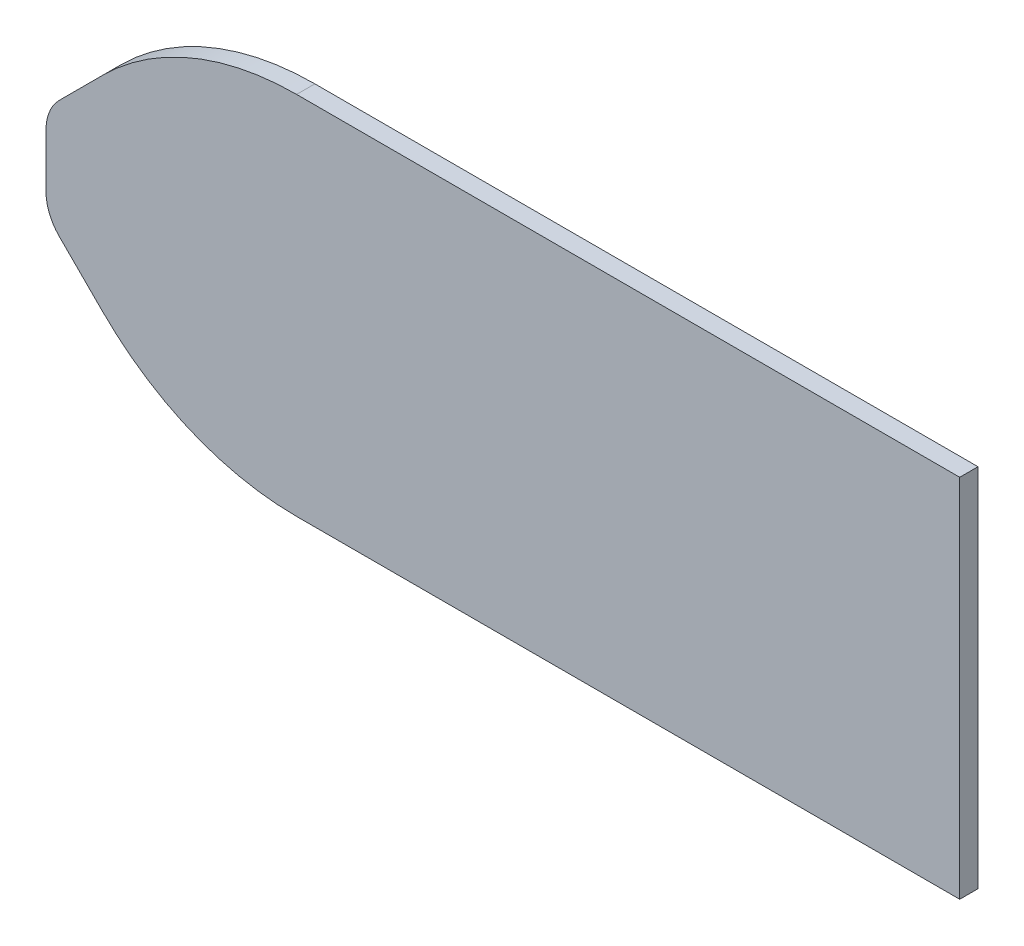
ISO-10303-21;
HEADER;
FILE_DESCRIPTION(('STEP AP214'),'2;1');
FILE_NAME('part.step','',(''),(''),'','','');
FILE_SCHEMA(('AUTOMOTIVE_DESIGN { 1 0 10303 214 1 1 1 1 }'));
ENDSEC;
DATA;
#1=APPLICATION_CONTEXT('core data for automotive mechanical design processes');
#2=APPLICATION_PROTOCOL_DEFINITION('international standard','automotive_design',2000,#1);
#3=PRODUCT_CONTEXT('',#1,'mechanical');
#4=PRODUCT('Part','Part','',(#3));
#5=PRODUCT_RELATED_PRODUCT_CATEGORY('part','',(#4));
#6=PRODUCT_DEFINITION_FORMATION('','',#4);
#7=PRODUCT_DEFINITION_CONTEXT('part definition',#1,'design');
#8=PRODUCT_DEFINITION('design','',#6,#7);
#9=PRODUCT_DEFINITION_SHAPE('','',#8);
#10=(LENGTH_UNIT() NAMED_UNIT(*) SI_UNIT(.MILLI.,.METRE.));
#11=(NAMED_UNIT(*) PLANE_ANGLE_UNIT() SI_UNIT($,.RADIAN.));
#12=(NAMED_UNIT(*) SI_UNIT($,.STERADIAN.) SOLID_ANGLE_UNIT());
#13=UNCERTAINTY_MEASURE_WITH_UNIT(LENGTH_MEASURE(1.E-05),#10,'distance_accuracy_value','');
#14=(GEOMETRIC_REPRESENTATION_CONTEXT(3) GLOBAL_UNCERTAINTY_ASSIGNED_CONTEXT((#13)) GLOBAL_UNIT_ASSIGNED_CONTEXT((#10,
#11,#12)) REPRESENTATION_CONTEXT('',''));
#15=CARTESIAN_POINT('',(0.,0.,0.));
#16=DIRECTION('',(0.,0.,1.));
#17=DIRECTION('',(1.,0.,0.));
#18=AXIS2_PLACEMENT_3D('',#15,#16,#17);
#19=CARTESIAN_POINT('',(100.,40.,4.));
#20=DIRECTION('',(-1.,0.,0.));
#21=DIRECTION('',(0.,0.,1.));
#22=AXIS2_PLACEMENT_3D('',#19,#20,#21);
#23=PLANE('',#22);
#24=DIRECTION('',(0.,1.,0.));
#25=VECTOR('',#24,1.);
#26=CARTESIAN_POINT('',(100.,40.,0.));
#27=LINE('',#26,#25);
#28=CARTESIAN_POINT('',(100.,-40.,0.));
#29=VERTEX_POINT('',#28);
#30=CARTESIAN_POINT('',(100.,40.,0.));
#31=VERTEX_POINT('',#30);
#32=EDGE_CURVE('E152',#29,#31,#27,.T.);
#33=ORIENTED_EDGE('',*,*,#32,.T.);
#34=DIRECTION('',(0.,0.,-1.));
#35=VECTOR('',#34,1.);
#36=CARTESIAN_POINT('',(100.,40.,4.));
#37=LINE('',#36,#35);
#38=CARTESIAN_POINT('',(100.,40.,4.));
#39=VERTEX_POINT('',#38);
#40=EDGE_CURVE('E11',#39,#31,#37,.T.);
#41=ORIENTED_EDGE('',*,*,#40,.F.);
#42=DIRECTION('',(0.,1.,0.));
#43=VECTOR('',#42,1.);
#44=CARTESIAN_POINT('',(100.,40.,4.));
#45=LINE('',#44,#43);
#46=CARTESIAN_POINT('',(100.,-40.,4.));
#47=VERTEX_POINT('',#46);
#48=EDGE_CURVE('E180',#47,#39,#45,.T.);
#49=ORIENTED_EDGE('',*,*,#48,.F.);
#50=DIRECTION('',(0.,0.,-1.));
#51=VECTOR('',#50,1.);
#52=CARTESIAN_POINT('',(100.,-40.,4.));
#53=LINE('',#52,#51);
#54=EDGE_CURVE('E148',#47,#29,#53,.T.);
#55=ORIENTED_EDGE('',*,*,#54,.T.);
#56=EDGE_LOOP('',(#33,#41,#49,#55));
#57=FACE_BOUND('',#56,.T.);
#58=ADVANCED_FACE('F39',(#57),#23,.F.);
#59=CARTESIAN_POINT('',(-45.147186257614,40.,4.));
#60=DIRECTION('',(0.,-1.,0.));
#61=DIRECTION('',(0.,0.,-1.));
#62=AXIS2_PLACEMENT_3D('',#59,#60,#61);
#63=PLANE('',#62);
#64=DIRECTION('',(-1.,0.,0.));
#65=VECTOR('',#64,1.);
#66=CARTESIAN_POINT('',(-45.147186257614,40.,0.));
#67=LINE('',#66,#65);
#68=CARTESIAN_POINT('',(-45.147186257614,40.,0.));
#69=VERTEX_POINT('',#68);
#70=EDGE_CURVE('E156',#31,#69,#67,.T.);
#71=ORIENTED_EDGE('',*,*,#70,.T.);
#72=DIRECTION('',(0.,0.,-1.));
#73=VECTOR('',#72,1.);
#74=CARTESIAN_POINT('',(-45.147186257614,40.,4.));
#75=LINE('',#74,#73);
#76=CARTESIAN_POINT('',(-45.147186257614,40.,4.));
#77=VERTEX_POINT('',#76);
#78=EDGE_CURVE('E48',#77,#69,#75,.T.);
#79=ORIENTED_EDGE('',*,*,#78,.F.);
#80=DIRECTION('',(-1.,0.,0.));
#81=VECTOR('',#80,1.);
#82=CARTESIAN_POINT('',(-45.147186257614,40.,4.));
#83=LINE('',#82,#81);
#84=EDGE_CURVE('E105',#39,#77,#83,.T.);
#85=ORIENTED_EDGE('',*,*,#84,.F.);
#86=ORIENTED_EDGE('',*,*,#40,.T.);
#87=EDGE_LOOP('',(#71,#79,#85,#86));
#88=FACE_BOUND('',#87,.T.);
#89=ADVANCED_FACE('F244',(#88),#63,.F.);
#90=CARTESIAN_POINT('',(-45.1471862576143,-20.,4.));
#91=DIRECTION('',(0.,0.,-1.));
#92=DIRECTION('',(-1.,0.,0.));
#93=AXIS2_PLACEMENT_3D('',#90,#91,#92);
#94=CYLINDRICAL_SURFACE('',#93,60.);
#95=CARTESIAN_POINT('',(-45.1471862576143,-20.,0.));
#96=DIRECTION('',(0.,0.,1.));
#97=DIRECTION('',(-1.,0.,0.));
#98=AXIS2_PLACEMENT_3D('',#95,#96,#97);
#99=CIRCLE('',#98,60.);
#100=CARTESIAN_POINT('',(-87.5735931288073,22.4264068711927,0.));
#101=VERTEX_POINT('',#100);
#102=EDGE_CURVE('E159',#69,#101,#99,.T.);
#103=ORIENTED_EDGE('',*,*,#102,.T.);
#104=DIRECTION('',(0.,0.,-1.));
#105=VECTOR('',#104,1.);
#106=CARTESIAN_POINT('',(-87.5735931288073,22.4264068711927,4.));
#107=LINE('',#106,#105);
#108=CARTESIAN_POINT('',(-87.5735931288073,22.4264068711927,4.));
#109=VERTEX_POINT('',#108);
#110=EDGE_CURVE('E199',#109,#101,#107,.T.);
#111=ORIENTED_EDGE('',*,*,#110,.F.);
#112=CARTESIAN_POINT('',(-45.1471862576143,-20.,4.));
#113=DIRECTION('',(0.,0.,1.));
#114=DIRECTION('',(-1.,0.,0.));
#115=AXIS2_PLACEMENT_3D('',#112,#113,#114);
#116=CIRCLE('',#115,60.);
#117=EDGE_CURVE('E209',#77,#109,#116,.T.);
#118=ORIENTED_EDGE('',*,*,#117,.F.);
#119=ORIENTED_EDGE('',*,*,#78,.T.);
#120=EDGE_LOOP('',(#103,#111,#118,#119));
#121=FACE_BOUND('',#120,.T.);
#122=ADVANCED_FACE('F207',(#121),#94,.T.);
#123=CARTESIAN_POINT('',(-97.0710678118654,12.9289321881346,4.));
#124=DIRECTION('',(0.707106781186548,-0.707106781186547,0.));
#125=DIRECTION('',(0.707106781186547,0.707106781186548,0.));
#126=AXIS2_PLACEMENT_3D('',#123,#124,#125);
#127=PLANE('',#126);
#128=DIRECTION('',(-0.707106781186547,-0.707106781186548,0.));
#129=VECTOR('',#128,1.);
#130=CARTESIAN_POINT('',(-97.0710678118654,12.9289321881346,0.));
#131=LINE('',#130,#129);
#132=CARTESIAN_POINT('',(-97.0710678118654,12.9289321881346,0.));
#133=VERTEX_POINT('',#132);
#134=EDGE_CURVE('E162',#101,#133,#131,.T.);
#135=ORIENTED_EDGE('',*,*,#134,.T.);
#136=DIRECTION('',(0.,0.,-1.));
#137=VECTOR('',#136,1.);
#138=CARTESIAN_POINT('',(-97.0710678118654,12.9289321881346,4.));
#139=LINE('',#138,#137);
#140=CARTESIAN_POINT('',(-97.0710678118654,12.9289321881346,4.));
#141=VERTEX_POINT('',#140);
#142=EDGE_CURVE('E195',#141,#133,#139,.T.);
#143=ORIENTED_EDGE('',*,*,#142,.F.);
#144=DIRECTION('',(-0.707106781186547,-0.707106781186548,0.));
#145=VECTOR('',#144,1.);
#146=CARTESIAN_POINT('',(-97.0710678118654,12.9289321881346,4.));
#147=LINE('',#146,#145);
#148=EDGE_CURVE('E228',#109,#141,#147,.T.);
#149=ORIENTED_EDGE('',*,*,#148,.F.);
#150=ORIENTED_EDGE('',*,*,#110,.T.);
#151=EDGE_LOOP('',(#135,#143,#149,#150));
#152=FACE_BOUND('',#151,.T.);
#153=ADVANCED_FACE('F218',(#152),#127,.F.);
#154=CARTESIAN_POINT('',(-90.,5.85786437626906,4.));
#155=DIRECTION('',(0.,0.,-1.));
#156=DIRECTION('',(-1.,0.,0.));
#157=AXIS2_PLACEMENT_3D('',#154,#155,#156);
#158=CYLINDRICAL_SURFACE('',#157,9.99999999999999);
#159=CARTESIAN_POINT('',(-90.,5.85786437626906,0.));
#160=DIRECTION('',(0.,0.,1.));
#161=DIRECTION('',(1.,0.,0.));
#162=AXIS2_PLACEMENT_3D('',#159,#160,#161);
#163=CIRCLE('',#162,9.99999999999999);
#164=CARTESIAN_POINT('',(-100.,5.85786437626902,0.));
#165=VERTEX_POINT('',#164);
#166=EDGE_CURVE('E165',#133,#165,#163,.T.);
#167=ORIENTED_EDGE('',*,*,#166,.T.);
#168=DIRECTION('',(0.,0.,-1.));
#169=VECTOR('',#168,1.);
#170=CARTESIAN_POINT('',(-100.,5.85786437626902,4.));
#171=LINE('',#170,#169);
#172=CARTESIAN_POINT('',(-100.,5.85786437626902,4.));
#173=VERTEX_POINT('',#172);
#174=EDGE_CURVE('E191',#173,#165,#171,.T.);
#175=ORIENTED_EDGE('',*,*,#174,.F.);
#176=CARTESIAN_POINT('',(-90.,5.85786437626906,4.));
#177=DIRECTION('',(0.,0.,1.));
#178=DIRECTION('',(1.,0.,0.));
#179=AXIS2_PLACEMENT_3D('',#176,#177,#178);
#180=CIRCLE('',#179,9.99999999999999);
#181=EDGE_CURVE('E224',#141,#173,#180,.T.);
#182=ORIENTED_EDGE('',*,*,#181,.F.);
#183=ORIENTED_EDGE('',*,*,#142,.T.);
#184=EDGE_LOOP('',(#167,#175,#182,#183));
#185=FACE_BOUND('',#184,.T.);
#186=ADVANCED_FACE('F222',(#185),#158,.T.);
#187=CARTESIAN_POINT('',(-100.,5.85786437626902,4.));
#188=DIRECTION('',(1.,0.,0.));
#189=DIRECTION('',(0.,0.,-1.));
#190=AXIS2_PLACEMENT_3D('',#187,#188,#189);
#191=PLANE('',#190);
#192=DIRECTION('',(0.,-1.,0.));
#193=VECTOR('',#192,1.);
#194=CARTESIAN_POINT('',(-100.,5.85786437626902,0.));
#195=LINE('',#194,#193);
#196=CARTESIAN_POINT('',(-100.,-5.85786437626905,0.));
#197=VERTEX_POINT('',#196);
#198=EDGE_CURVE('E168',#165,#197,#195,.T.);
#199=ORIENTED_EDGE('',*,*,#198,.T.);
#200=DIRECTION('',(0.,0.,-1.));
#201=VECTOR('',#200,1.);
#202=CARTESIAN_POINT('',(-100.,-5.85786437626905,4.));
#203=LINE('',#202,#201);
#204=CARTESIAN_POINT('',(-100.,-5.85786437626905,4.));
#205=VERTEX_POINT('',#204);
#206=EDGE_CURVE('E187',#205,#197,#203,.T.);
#207=ORIENTED_EDGE('',*,*,#206,.F.);
#208=DIRECTION('',(0.,-1.,0.));
#209=VECTOR('',#208,1.);
#210=CARTESIAN_POINT('',(-100.,5.85786437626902,4.));
#211=LINE('',#210,#209);
#212=EDGE_CURVE('E227',#173,#205,#211,.T.);
#213=ORIENTED_EDGE('',*,*,#212,.F.);
#214=ORIENTED_EDGE('',*,*,#174,.T.);
#215=EDGE_LOOP('',(#199,#207,#213,#214));
#216=FACE_BOUND('',#215,.T.);
#217=ADVANCED_FACE('F256',(#216),#191,.F.);
#218=CARTESIAN_POINT('',(-90.,-5.85786437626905,4.));
#219=DIRECTION('',(0.,0.,-1.));
#220=DIRECTION('',(-1.,0.,0.));
#221=AXIS2_PLACEMENT_3D('',#218,#219,#220);
#222=CYLINDRICAL_SURFACE('',#221,9.99999999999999);
#223=CARTESIAN_POINT('',(-90.,-5.85786437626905,0.));
#224=DIRECTION('',(0.,0.,1.));
#225=DIRECTION('',(-1.,0.,0.));
#226=AXIS2_PLACEMENT_3D('',#223,#224,#225);
#227=CIRCLE('',#226,9.99999999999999);
#228=CARTESIAN_POINT('',(-97.0710678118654,-12.9289321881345,0.));
#229=VERTEX_POINT('',#228);
#230=EDGE_CURVE('E171',#197,#229,#227,.T.);
#231=ORIENTED_EDGE('',*,*,#230,.T.);
#232=DIRECTION('',(0.,0.,-1.));
#233=VECTOR('',#232,1.);
#234=CARTESIAN_POINT('',(-97.0710678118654,-12.9289321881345,4.));
#235=LINE('',#234,#233);
#236=CARTESIAN_POINT('',(-97.0710678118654,-12.9289321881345,4.));
#237=VERTEX_POINT('',#236);
#238=EDGE_CURVE('E141',#237,#229,#235,.T.);
#239=ORIENTED_EDGE('',*,*,#238,.F.);
#240=CARTESIAN_POINT('',(-90.,-5.85786437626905,4.));
#241=DIRECTION('',(0.,0.,1.));
#242=DIRECTION('',(-1.,0.,0.));
#243=AXIS2_PLACEMENT_3D('',#240,#241,#242);
#244=CIRCLE('',#243,9.99999999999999);
#245=EDGE_CURVE('E130',#205,#237,#244,.T.);
#246=ORIENTED_EDGE('',*,*,#245,.F.);
#247=ORIENTED_EDGE('',*,*,#206,.T.);
#248=EDGE_LOOP('',(#231,#239,#246,#247));
#249=FACE_BOUND('',#248,.T.);
#250=ADVANCED_FACE('F259',(#249),#222,.T.);
#251=CARTESIAN_POINT('',(-97.0710678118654,-12.9289321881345,4.));
#252=DIRECTION('',(0.707106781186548,0.707106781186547,0.));
#253=DIRECTION('',(-0.707106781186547,0.707106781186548,0.));
#254=AXIS2_PLACEMENT_3D('',#251,#252,#253);
#255=PLANE('',#254);
#256=DIRECTION('',(0.707106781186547,-0.707106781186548,0.));
#257=VECTOR('',#256,1.);
#258=CARTESIAN_POINT('',(-97.0710678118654,-12.9289321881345,0.));
#259=LINE('',#258,#257);
#260=CARTESIAN_POINT('',(-87.5735931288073,-22.4264068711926,0.));
#261=VERTEX_POINT('',#260);
#262=EDGE_CURVE('E139',#229,#261,#259,.T.);
#263=ORIENTED_EDGE('',*,*,#262,.T.);
#264=DIRECTION('',(0.,0.,-1.));
#265=VECTOR('',#264,1.);
#266=CARTESIAN_POINT('',(-87.5735931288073,-22.4264068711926,4.));
#267=LINE('',#266,#265);
#268=CARTESIAN_POINT('',(-87.5735931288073,-22.4264068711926,4.));
#269=VERTEX_POINT('',#268);
#270=EDGE_CURVE('E136',#269,#261,#267,.T.);
#271=ORIENTED_EDGE('',*,*,#270,.F.);
#272=DIRECTION('',(0.707106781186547,-0.707106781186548,0.));
#273=VECTOR('',#272,1.);
#274=CARTESIAN_POINT('',(-97.0710678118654,-12.9289321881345,4.));
#275=LINE('',#274,#273);
#276=EDGE_CURVE('E124',#237,#269,#275,.T.);
#277=ORIENTED_EDGE('',*,*,#276,.F.);
#278=ORIENTED_EDGE('',*,*,#238,.T.);
#279=EDGE_LOOP('',(#263,#271,#277,#278));
#280=FACE_BOUND('',#279,.T.);
#281=ADVANCED_FACE('F137',(#280),#255,.F.);
#282=CARTESIAN_POINT('',(-45.1471862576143,20.,4.));
#283=DIRECTION('',(0.,0.,-1.));
#284=DIRECTION('',(-1.,0.,0.));
#285=AXIS2_PLACEMENT_3D('',#282,#283,#284);
#286=CYLINDRICAL_SURFACE('',#285,60.);
#287=CARTESIAN_POINT('',(-45.1471862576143,20.,0.));
#288=DIRECTION('',(0.,0.,1.));
#289=DIRECTION('',(1.,0.,0.));
#290=AXIS2_PLACEMENT_3D('',#287,#288,#289);
#291=CIRCLE('',#290,60.);
#292=CARTESIAN_POINT('',(-45.147186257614,-40.,0.));
#293=VERTEX_POINT('',#292);
#294=EDGE_CURVE('E91',#261,#293,#291,.T.);
#295=ORIENTED_EDGE('',*,*,#294,.T.);
#296=DIRECTION('',(0.,0.,-1.));
#297=VECTOR('',#296,1.);
#298=CARTESIAN_POINT('',(-45.147186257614,-40.,4.));
#299=LINE('',#298,#297);
#300=CARTESIAN_POINT('',(-45.147186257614,-40.,4.));
#301=VERTEX_POINT('',#300);
#302=EDGE_CURVE('E142',#301,#293,#299,.T.);
#303=ORIENTED_EDGE('',*,*,#302,.F.);
#304=CARTESIAN_POINT('',(-45.1471862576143,20.,4.));
#305=DIRECTION('',(0.,0.,1.));
#306=DIRECTION('',(1.,0.,0.));
#307=AXIS2_PLACEMENT_3D('',#304,#305,#306);
#308=CIRCLE('',#307,60.);
#309=EDGE_CURVE('E128',#269,#301,#308,.T.);
#310=ORIENTED_EDGE('',*,*,#309,.F.);
#311=ORIENTED_EDGE('',*,*,#270,.T.);
#312=EDGE_LOOP('',(#295,#303,#310,#311));
#313=FACE_BOUND('',#312,.T.);
#314=ADVANCED_FACE('F144',(#313),#286,.T.);
#315=CARTESIAN_POINT('',(-45.147186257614,-40.,4.));
#316=DIRECTION('',(0.,1.,0.));
#317=DIRECTION('',(0.,0.,1.));
#318=AXIS2_PLACEMENT_3D('',#315,#316,#317);
#319=PLANE('',#318);
#320=DIRECTION('',(1.,0.,0.));
#321=VECTOR('',#320,1.);
#322=CARTESIAN_POINT('',(-45.147186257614,-40.,0.));
#323=LINE('',#322,#321);
#324=EDGE_CURVE('E97',#293,#29,#323,.T.);
#325=ORIENTED_EDGE('',*,*,#324,.T.);
#326=ORIENTED_EDGE('',*,*,#54,.F.);
#327=DIRECTION('',(1.,0.,0.));
#328=VECTOR('',#327,1.);
#329=CARTESIAN_POINT('',(-45.147186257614,-40.,4.));
#330=LINE('',#329,#328);
#331=EDGE_CURVE('E56',#301,#47,#330,.T.);
#332=ORIENTED_EDGE('',*,*,#331,.F.);
#333=ORIENTED_EDGE('',*,*,#302,.T.);
#334=EDGE_LOOP('',(#325,#326,#332,#333));
#335=FACE_BOUND('',#334,.T.);
#336=ADVANCED_FACE('F268',(#335),#319,.F.);
#337=CARTESIAN_POINT('',(-45.1471862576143,20.,4.));
#338=DIRECTION('',(0.,0.,1.));
#339=DIRECTION('',(1.,0.,0.));
#340=AXIS2_PLACEMENT_3D('',#337,#338,#339);
#341=PLANE('',#340);
#342=ORIENTED_EDGE('',*,*,#48,.T.);
#343=ORIENTED_EDGE('',*,*,#84,.T.);
#344=ORIENTED_EDGE('',*,*,#117,.T.);
#345=ORIENTED_EDGE('',*,*,#148,.T.);
#346=ORIENTED_EDGE('',*,*,#181,.T.);
#347=ORIENTED_EDGE('',*,*,#212,.T.);
#348=ORIENTED_EDGE('',*,*,#245,.T.);
#349=ORIENTED_EDGE('',*,*,#276,.T.);
#350=ORIENTED_EDGE('',*,*,#309,.T.);
#351=ORIENTED_EDGE('',*,*,#331,.T.);
#352=EDGE_LOOP('',(#342,#343,#344,#345,#346,#347,#348,#349,#350,#351));
#353=FACE_BOUND('',#352,.T.);
#354=ADVANCED_FACE('F126',(#353),#341,.T.);
#355=CARTESIAN_POINT('',(-45.1471862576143,20.,0.));
#356=DIRECTION('',(0.,0.,1.));
#357=DIRECTION('',(1.,0.,0.));
#358=AXIS2_PLACEMENT_3D('',#355,#356,#357);
#359=PLANE('',#358);
#360=ORIENTED_EDGE('',*,*,#32,.F.);
#361=ORIENTED_EDGE('',*,*,#324,.F.);
#362=ORIENTED_EDGE('',*,*,#294,.F.);
#363=ORIENTED_EDGE('',*,*,#262,.F.);
#364=ORIENTED_EDGE('',*,*,#230,.F.);
#365=ORIENTED_EDGE('',*,*,#198,.F.);
#366=ORIENTED_EDGE('',*,*,#166,.F.);
#367=ORIENTED_EDGE('',*,*,#134,.F.);
#368=ORIENTED_EDGE('',*,*,#102,.F.);
#369=ORIENTED_EDGE('',*,*,#70,.F.);
#370=EDGE_LOOP('',(#360,#361,#362,#363,#364,#365,#366,#367,#368,#369));
#371=FACE_BOUND('',#370,.T.);
#372=ADVANCED_FACE('F213',(#371),#359,.F.);
#373=CLOSED_SHELL('',(#58,#89,#122,#153,#186,#217,#250,#281,#314,#336,#354,#372));
#374=MANIFOLD_SOLID_BREP('B2',#373);
#375=ADVANCED_BREP_SHAPE_REPRESENTATION('',(#18,#374),#14);
#376=SHAPE_DEFINITION_REPRESENTATION(#9,#375);
ENDSEC;
END-ISO-10303-21;
